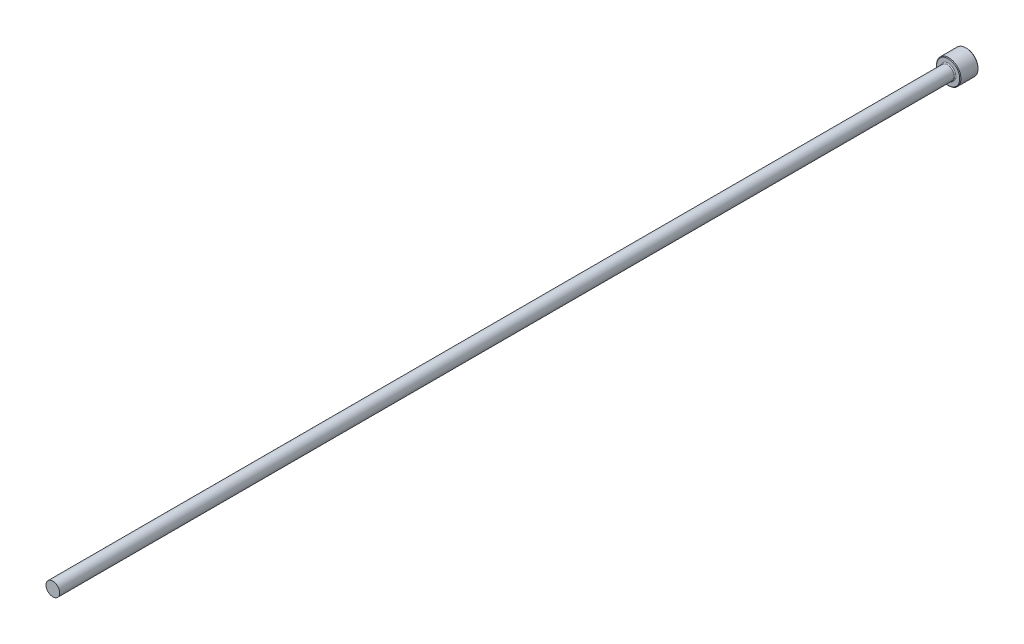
from build123d import *

# Parameters (mm, degrees)
CHAMFER1_SIZE = 0.2


with BuildPart() as part:
    # Sketch1 → Revolve1 (revolve)
    with BuildSketch(Plane(origin=(0, 0, 0), x_dir=(0, 0, -1), z_dir=(1, 0, 0)), mode=Mode.PRIVATE) as revolve1_sk:
        with BuildLine():
            Line((0, 0), (0, 4))
            Line((0, 4), (-6, 4))
            Line((-6, 4), (-6, 2.55))
            ThreePointArc((-6, 2.55), (-6.087867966, 2.337867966), (-6.3, 2.25))
            Line((-6.3, 2.25), (-300, 2.25))
            Line((-300, 2.25), (-300, 0))
            Line((-300, 0), (0, 0))
        make_face()
    revolve(revolve1_sk.sketch.rotate(Axis((0, 0, 109.05062828), (0, 0, -1)), 90), axis=Axis((0, 0, 109.05062828), (0, 0, -1)))

    # Chamfer1
    chamfer1_edges = [part.edges().sort_by_distance(p)[0] for p in [
        (-4, 0, 0),
        (-4, 0, 6),
    ]]
    chamfer(chamfer1_edges, length=CHAMFER1_SIZE)


solid = part.part
